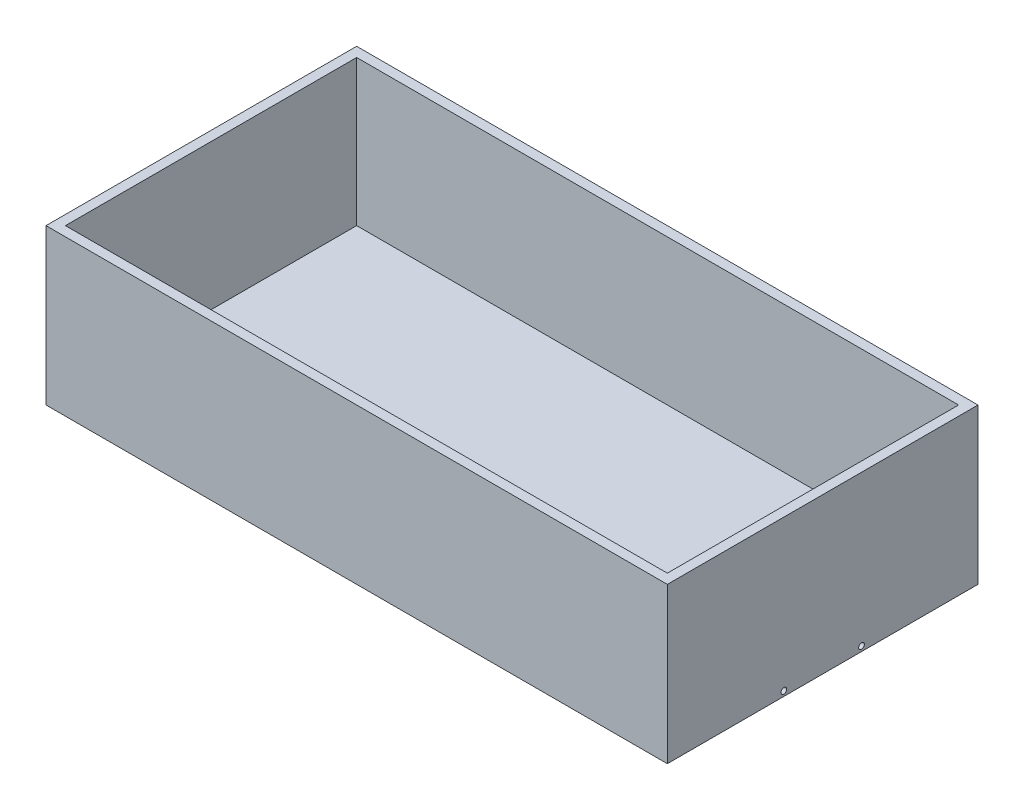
from build123d import *

# Parameters (mm, degrees)
SKETCH1_W                      = 203.2
SKETCH1_H                      = 101.6
BOSS_EXTRUDE2_DEPTH            = 50.8
SKETCH2_W                      = 196.85
SKETCH2_H                      = 95.25
CUT_EXTRUDE1_DEPTH             = 47.625
F_1_64_TAPPED_HOLE1_AT_2_COUNT = 2
F_1_64_TAPPED_HOLE1_AT_2_PITCH = 25.4


with BuildPart() as part:
    # Sketch1 → Boss-Extrude2 (new body)
    with BuildSketch(Plane(origin=(0, 0, 0), x_dir=(1, 0, 0), z_dir=(0, 1, 0))):
        Rectangle(SKETCH1_W, SKETCH1_H)
    extrude(amount=BOSS_EXTRUDE2_DEPTH)

    # Sketch2 → Cut-Extrude1 (cut)
    with BuildSketch(Plane(origin=(0, 50.8, 0), x_dir=(1, 0, 0), z_dir=(0, 1, 0))):
        Rectangle(SKETCH2_W, SKETCH2_H)
    extrude(amount=-CUT_EXTRUDE1_DEPTH, mode=Mode.SUBTRACT)

    # Sketch6 → 1-64 Tapped Hole1 (revolve, cut)
    with BuildSketch(Plane(origin=(-101.6, 1.5875, -12.70392911), x_dir=(0, 0, 1), z_dir=(0, 1, 0))):
        Polygon((0, 0), (0, 5.534040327), (0.75565, 5.08), (0.75565, 3.81), (0.9271, 3.81), (0.9271, 0), align=None)
    f_1_64_tapped_hole1 = revolve(axis=Axis((-107.95, 1.5875, -12.70392911), (1, 0, 0)), mode=Mode.SUBTRACT)

    # 1-64 Tapped Hole1 at 2: 1-64 Tapped Hole1 ×2
    with Locations(*[(0, 0, i * F_1_64_TAPPED_HOLE1_AT_2_PITCH) for i in range(1, F_1_64_TAPPED_HOLE1_AT_2_COUNT)]):
        add(f_1_64_tapped_hole1, mode=Mode.SUBTRACT)

    # Mirror1: 1-64 Tapped Hole1 across plane
    add(f_1_64_tapped_hole1.mirror(Plane(origin=(0, 0, 0), x_dir=(0, 0, 1), z_dir=(1, 0, 0))), mode=Mode.SUBTRACT)

    # Mirror1 copy 1 sketch → Mirror1 copy 1 (revolve, cut)
    with BuildSketch(Plane(origin=(101.6, 1.5875, 12.69607089), x_dir=(0, 0, 1), z_dir=(0, 1, 0))):
        Polygon((0, 0), (0, -5.534040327), (0.75565, -5.08), (0.75565, -3.81), (0.9271, -3.81), (0.9271, 0), align=None)
    revolve(axis=Axis((107.95, 1.5875, 12.69607089), (1, 0, 0)), mode=Mode.SUBTRACT)


solid = part.part
